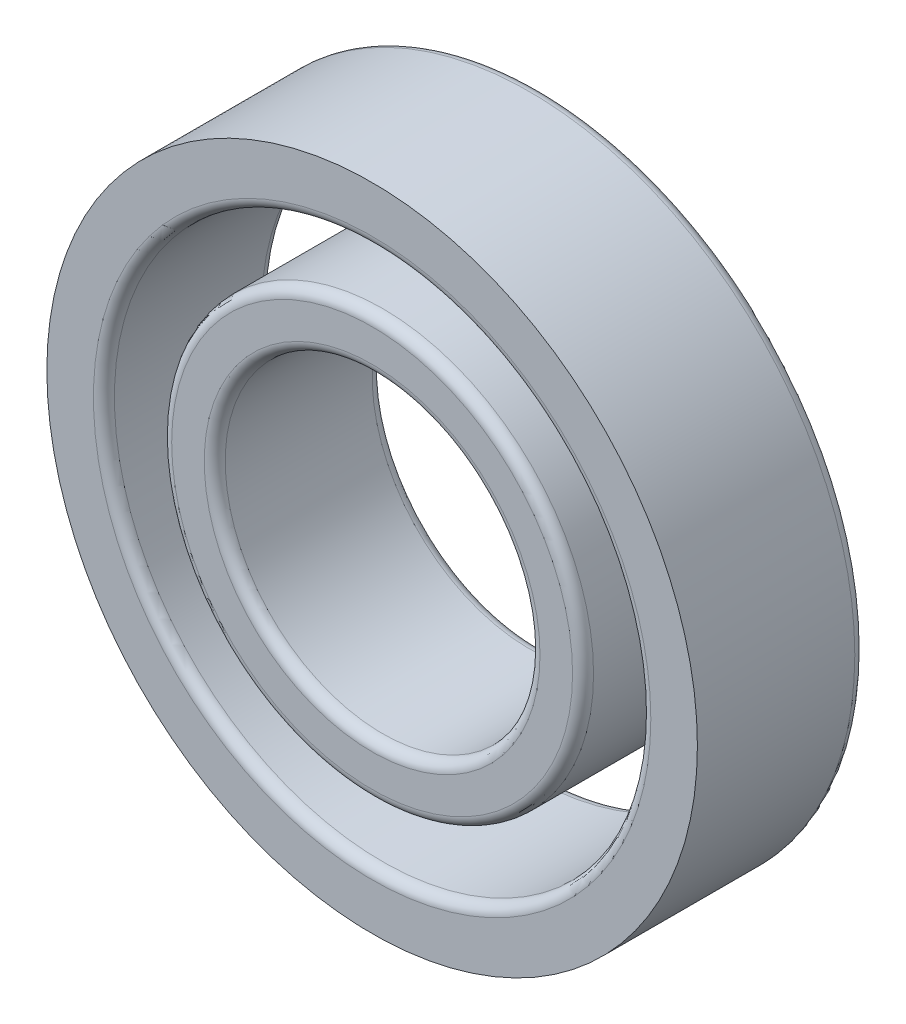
from build123d import *

# Parameters (mm, degrees)
ESQUISSE1_R          = 31
ESQUISSE1_R_2        = 25.560271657
BOSS_EXTRU_1_DEPTH   = 16
ESQUISSE1_R_3        = 20.102897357
ESQUISSE1_R_4        = 15
BOSS_EXTRU_1_2_DEPTH = 16
CONG_1_R             = 1
CONG_2_R             = 1


with BuildPart() as part:
    # Esquisse1 → Boss.-Extru.1 (new body)
    with BuildSketch(Plane.XY):
        Circle(ESQUISSE1_R)
        Circle(ESQUISSE1_R_2, mode=Mode.SUBTRACT)
    extrude(amount=BOSS_EXTRU_1_DEPTH)

    # Cong_1
    cong_1_edges = [part.edges().sort_by_distance(p)[0] for p in [
        (-31, 0, 0),
        (-25.560271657, 0, 0),
        (-25.560271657, 0, 16),
    ]]
    fillet(cong_1_edges, radius=CONG_1_R)


with BuildPart() as body_2:
    # Esquisse1 → Boss.-Extru.1 2 (new body)
    with BuildSketch(Plane.XY):
        Circle(ESQUISSE1_R_3)
        Circle(ESQUISSE1_R_4, mode=Mode.SUBTRACT)
    extrude(amount=BOSS_EXTRU_1_2_DEPTH)

    # Cong_2
    cong_2_edges = [body_2.edges().sort_by_distance(p)[0] for p in [
        (-20.102897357, 0, 16),
        (-20.102897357, 0, 0),
        (-15, 0, 0),
        (-15, 0, 16),
    ]]
    fillet(cong_2_edges, radius=CONG_2_R)


solid = Compound([part.part, body_2.part])
